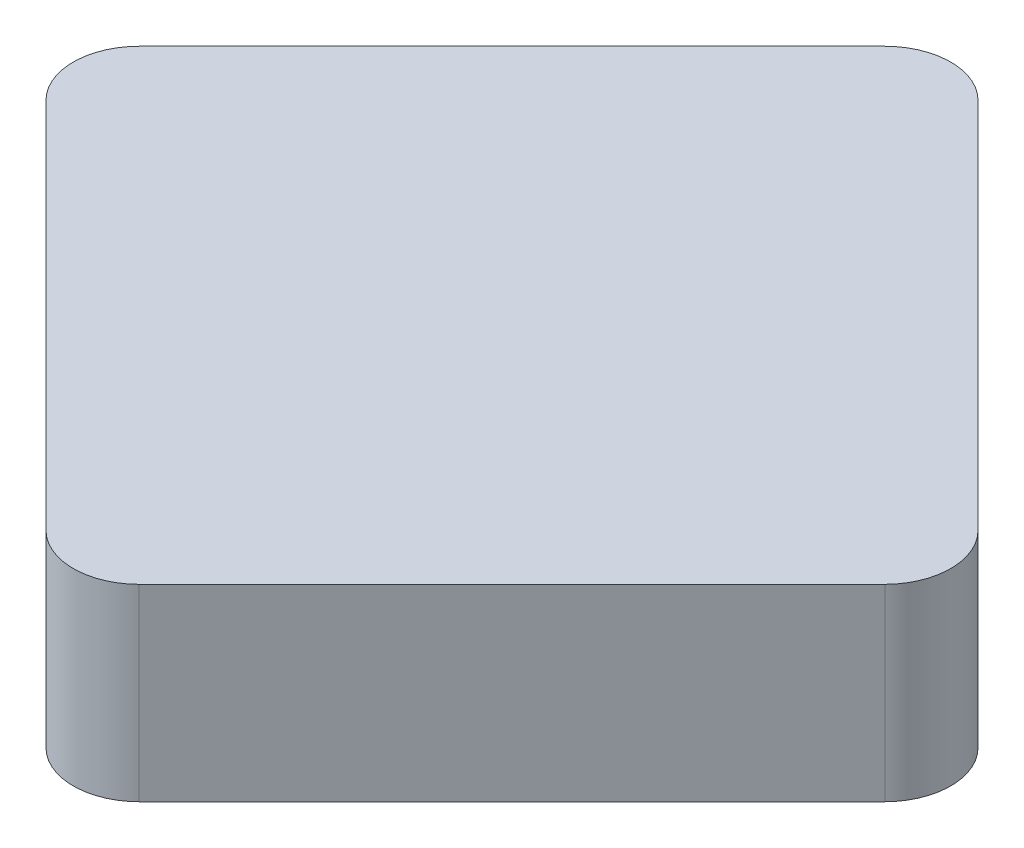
ISO-10303-21;
HEADER;
FILE_DESCRIPTION(('STEP AP214'),'2;1');
FILE_NAME('part.step','',(''),(''),'','','');
FILE_SCHEMA(('AUTOMOTIVE_DESIGN { 1 0 10303 214 1 1 1 1 }'));
ENDSEC;
DATA;
#1=APPLICATION_CONTEXT('core data for automotive mechanical design processes');
#2=APPLICATION_PROTOCOL_DEFINITION('international standard','automotive_design',2000,#1);
#3=PRODUCT_CONTEXT('',#1,'mechanical');
#4=PRODUCT('Part','Part','',(#3));
#5=PRODUCT_RELATED_PRODUCT_CATEGORY('part','',(#4));
#6=PRODUCT_DEFINITION_FORMATION('','',#4);
#7=PRODUCT_DEFINITION_CONTEXT('part definition',#1,'design');
#8=PRODUCT_DEFINITION('design','',#6,#7);
#9=PRODUCT_DEFINITION_SHAPE('','',#8);
#10=(LENGTH_UNIT() NAMED_UNIT(*) SI_UNIT(.MILLI.,.METRE.));
#11=(NAMED_UNIT(*) PLANE_ANGLE_UNIT() SI_UNIT($,.RADIAN.));
#12=(NAMED_UNIT(*) SI_UNIT($,.STERADIAN.) SOLID_ANGLE_UNIT());
#13=UNCERTAINTY_MEASURE_WITH_UNIT(LENGTH_MEASURE(1.E-05),#10,'distance_accuracy_value','');
#14=(GEOMETRIC_REPRESENTATION_CONTEXT(3) GLOBAL_UNCERTAINTY_ASSIGNED_CONTEXT((#13)) GLOBAL_UNIT_ASSIGNED_CONTEXT((#10,
#11,#12)) REPRESENTATION_CONTEXT('',''));
#15=CARTESIAN_POINT('',(0.,0.,0.));
#16=DIRECTION('',(0.,0.,1.));
#17=DIRECTION('',(1.,0.,0.));
#18=AXIS2_PLACEMENT_3D('',#15,#16,#17);
#19=CARTESIAN_POINT('',(0.,-0.0005,0.));
#20=DIRECTION('',(0.,1.,0.));
#21=DIRECTION('',(0.,0.,1.));
#22=AXIS2_PLACEMENT_3D('',#19,#20,#21);
#23=CYLINDRICAL_SURFACE('',#22,0.000500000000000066);
#24=CARTESIAN_POINT('',(0.,0.,0.));
#25=DIRECTION('',(0.,1.,0.));
#26=DIRECTION('',(0.,0.,1.));
#27=AXIS2_PLACEMENT_3D('',#24,#25,#26);
#28=CIRCLE('',#27,0.000500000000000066);
#29=CARTESIAN_POINT('',(0.,0.,0.000500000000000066));
#30=VERTEX_POINT('',#29);
#31=EDGE_CURVE('E11',#30,#30,#28,.F.);
#32=ORIENTED_EDGE('',*,*,#31,.F.);
#33=EDGE_LOOP('',(#32));
#34=FACE_BOUND('',#33,.T.);
#35=CARTESIAN_POINT('',(0.,0.0005,0.));
#36=DIRECTION('',(0.,1.,0.));
#37=DIRECTION('',(0.,0.,1.));
#38=AXIS2_PLACEMENT_3D('',#35,#36,#37);
#39=CIRCLE('',#38,0.000500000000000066);
#40=CARTESIAN_POINT('',(0.,0.0005,0.000500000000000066));
#41=VERTEX_POINT('',#40);
#42=EDGE_CURVE('E38',#41,#41,#39,.T.);
#43=ORIENTED_EDGE('',*,*,#42,.F.);
#44=EDGE_LOOP('',(#43));
#45=FACE_BOUND('',#44,.T.);
#46=ADVANCED_FACE('F30',(#34,#45),#23,.T.);
#47=CARTESIAN_POINT('',(0.,0.0005,0.));
#48=DIRECTION('',(0.,1.,0.));
#49=DIRECTION('',(0.,0.,1.));
#50=AXIS2_PLACEMENT_3D('',#47,#48,#49);
#51=PLANE('',#50);
#52=ORIENTED_EDGE('',*,*,#42,.T.);
#53=EDGE_LOOP('',(#52));
#54=FACE_BOUND('',#53,.T.);
#55=ADVANCED_FACE('F163',(#54),#51,.T.);
#56=CARTESIAN_POINT('',(0.,-3.42857142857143,0.));
#57=DIRECTION('',(0.,1.,0.));
#58=DIRECTION('',(0.,0.,1.));
#59=AXIS2_PLACEMENT_3D('',#56,#57,#58);
#60=CYLINDRICAL_SURFACE('',#59,1.2);
#61=CARTESIAN_POINT('',(0.,0.,0.));
#62=DIRECTION('',(0.,1.,0.));
#63=DIRECTION('',(0.,0.,1.));
#64=AXIS2_PLACEMENT_3D('',#61,#62,#63);
#65=CIRCLE('',#64,1.2);
#66=CARTESIAN_POINT('',(-0.848528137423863,0.,-0.84852813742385));
#67=VERTEX_POINT('',#66);
#68=CARTESIAN_POINT('',(-0.848528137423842,0.,0.848528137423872));
#69=VERTEX_POINT('',#68);
#70=EDGE_CURVE('E129',#67,#69,#65,.T.);
#71=ORIENTED_EDGE('',*,*,#70,.F.);
#72=DIRECTION('',(0.,1.,0.));
#73=VECTOR('',#72,1.);
#74=CARTESIAN_POINT('',(-0.848528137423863,-3.42857142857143,-0.84852813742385));
#75=LINE('',#74,#73);
#76=CARTESIAN_POINT('',(-0.848528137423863,-3.42857142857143,-0.84852813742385));
#77=VERTEX_POINT('',#76);
#78=EDGE_CURVE('E46',#77,#67,#75,.T.);
#79=ORIENTED_EDGE('',*,*,#78,.F.);
#80=CARTESIAN_POINT('',(0.,-3.42857142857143,0.));
#81=DIRECTION('',(0.,1.,0.));
#82=DIRECTION('',(0.,0.,1.));
#83=AXIS2_PLACEMENT_3D('',#80,#81,#82);
#84=CIRCLE('',#83,1.2);
#85=CARTESIAN_POINT('',(-0.848528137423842,-3.42857142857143,0.848528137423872));
#86=VERTEX_POINT('',#85);
#87=EDGE_CURVE('E150',#77,#86,#84,.T.);
#88=ORIENTED_EDGE('',*,*,#87,.T.);
#89=DIRECTION('',(0.,1.,0.));
#90=VECTOR('',#89,1.);
#91=CARTESIAN_POINT('',(-0.848528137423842,-3.42857142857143,0.848528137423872));
#92=LINE('',#91,#90);
#93=EDGE_CURVE('E87',#86,#69,#92,.T.);
#94=ORIENTED_EDGE('',*,*,#93,.T.);
#95=EDGE_LOOP('',(#71,#79,#88,#94));
#96=FACE_BOUND('',#95,.T.);
#97=ADVANCED_FACE('F170',(#96),#60,.T.);
#98=CARTESIAN_POINT('',(5.93969696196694,-3.42857142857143,-7.63675323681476));
#99=DIRECTION('',(-0.707106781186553,0.,-0.707106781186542));
#100=DIRECTION('',(-0.707106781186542,0.,0.707106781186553));
#101=AXIS2_PLACEMENT_3D('',#98,#99,#100);
#102=PLANE('',#101);
#103=DIRECTION('',(-0.707106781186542,0.,0.707106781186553));
#104=VECTOR('',#103,1.);
#105=CARTESIAN_POINT('',(5.93969696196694,0.,-7.63675323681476));
#106=LINE('',#105,#104);
#107=CARTESIAN_POINT('',(5.93969696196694,0.,-7.63675323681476));
#108=VERTEX_POINT('',#107);
#109=EDGE_CURVE('E147',#108,#67,#106,.T.);
#110=ORIENTED_EDGE('',*,*,#109,.F.);
#111=DIRECTION('',(0.,1.,0.));
#112=VECTOR('',#111,1.);
#113=CARTESIAN_POINT('',(5.93969696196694,-3.42857142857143,-7.63675323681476));
#114=LINE('',#113,#112);
#115=CARTESIAN_POINT('',(5.93969696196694,-3.42857142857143,-7.63675323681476));
#116=VERTEX_POINT('',#115);
#117=EDGE_CURVE('E75',#116,#108,#114,.T.);
#118=ORIENTED_EDGE('',*,*,#117,.F.);
#119=DIRECTION('',(-0.707106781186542,0.,0.707106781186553));
#120=VECTOR('',#119,1.);
#121=CARTESIAN_POINT('',(5.93969696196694,-3.42857142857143,-7.63675323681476));
#122=LINE('',#121,#120);
#123=EDGE_CURVE('E119',#116,#77,#122,.T.);
#124=ORIENTED_EDGE('',*,*,#123,.T.);
#125=ORIENTED_EDGE('',*,*,#78,.T.);
#126=EDGE_LOOP('',(#110,#118,#124,#125));
#127=FACE_BOUND('',#126,.T.);
#128=ADVANCED_FACE('F192',(#127),#102,.T.);
#129=CARTESIAN_POINT('',(6.7882250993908,-3.42857142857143,-6.78822509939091));
#130=DIRECTION('',(0.,1.,0.));
#131=DIRECTION('',(0.,0.,1.));
#132=AXIS2_PLACEMENT_3D('',#129,#130,#131);
#133=CYLINDRICAL_SURFACE('',#132,1.2);
#134=CARTESIAN_POINT('',(6.7882250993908,0.,-6.78822509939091));
#135=DIRECTION('',(0.,1.,0.));
#136=DIRECTION('',(0.,0.,1.));
#137=AXIS2_PLACEMENT_3D('',#134,#135,#136);
#138=CIRCLE('',#137,1.2);
#139=CARTESIAN_POINT('',(7.63675323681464,0.,-7.63675323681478));
#140=VERTEX_POINT('',#139);
#141=EDGE_CURVE('E106',#140,#108,#138,.T.);
#142=ORIENTED_EDGE('',*,*,#141,.F.);
#143=DIRECTION('',(0.,1.,0.));
#144=VECTOR('',#143,1.);
#145=CARTESIAN_POINT('',(7.63675323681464,-3.42857142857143,-7.63675323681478));
#146=LINE('',#145,#144);
#147=CARTESIAN_POINT('',(7.63675323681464,-3.42857142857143,-7.63675323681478));
#148=VERTEX_POINT('',#147);
#149=EDGE_CURVE('E101',#148,#140,#146,.T.);
#150=ORIENTED_EDGE('',*,*,#149,.F.);
#151=CARTESIAN_POINT('',(6.7882250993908,-3.42857142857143,-6.78822509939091));
#152=DIRECTION('',(0.,1.,0.));
#153=DIRECTION('',(0.,0.,1.));
#154=AXIS2_PLACEMENT_3D('',#151,#152,#153);
#155=CIRCLE('',#154,1.2);
#156=EDGE_CURVE('E104',#148,#116,#155,.T.);
#157=ORIENTED_EDGE('',*,*,#156,.T.);
#158=ORIENTED_EDGE('',*,*,#117,.T.);
#159=EDGE_LOOP('',(#142,#150,#157,#158));
#160=FACE_BOUND('',#159,.T.);
#161=ADVANCED_FACE('F103',(#160),#133,.T.);
#162=CARTESIAN_POINT('',(14.4249783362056,-3.42857142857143,-0.848528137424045));
#163=DIRECTION('',(0.707106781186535,0.,-0.70710678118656));
#164=DIRECTION('',(-0.70710678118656,0.,-0.707106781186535));
#165=AXIS2_PLACEMENT_3D('',#162,#163,#164);
#166=PLANE('',#165);
#167=DIRECTION('',(-0.70710678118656,0.,-0.707106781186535));
#168=VECTOR('',#167,1.);
#169=CARTESIAN_POINT('',(14.4249783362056,0.,-0.848528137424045));
#170=LINE('',#169,#168);
#171=CARTESIAN_POINT('',(14.4249783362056,0.,-0.848528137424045));
#172=VERTEX_POINT('',#171);
#173=EDGE_CURVE('E144',#172,#140,#170,.T.);
#174=ORIENTED_EDGE('',*,*,#173,.F.);
#175=DIRECTION('',(0.,1.,0.));
#176=VECTOR('',#175,1.);
#177=CARTESIAN_POINT('',(14.4249783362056,-3.42857142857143,-0.848528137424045));
#178=LINE('',#177,#176);
#179=CARTESIAN_POINT('',(14.4249783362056,-3.42857142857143,-0.848528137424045));
#180=VERTEX_POINT('',#179);
#181=EDGE_CURVE('E111',#180,#172,#178,.T.);
#182=ORIENTED_EDGE('',*,*,#181,.F.);
#183=DIRECTION('',(-0.70710678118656,0.,-0.707106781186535));
#184=VECTOR('',#183,1.);
#185=CARTESIAN_POINT('',(14.4249783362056,-3.42857142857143,-0.848528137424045));
#186=LINE('',#185,#184);
#187=EDGE_CURVE('E117',#180,#148,#186,.T.);
#188=ORIENTED_EDGE('',*,*,#187,.T.);
#189=ORIENTED_EDGE('',*,*,#149,.T.);
#190=EDGE_LOOP('',(#174,#182,#188,#189));
#191=FACE_BOUND('',#190,.T.);
#192=ADVANCED_FACE('F121',(#191),#166,.T.);
#193=CARTESIAN_POINT('',(13.5764501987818,-3.42857142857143,-1.74556549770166E-13));
#194=DIRECTION('',(0.,1.,0.));
#195=DIRECTION('',(0.,0.,1.));
#196=AXIS2_PLACEMENT_3D('',#193,#194,#195);
#197=CYLINDRICAL_SURFACE('',#196,1.2);
#198=CARTESIAN_POINT('',(13.5764501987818,0.,-1.74556549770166E-13));
#199=DIRECTION('',(0.,1.,0.));
#200=DIRECTION('',(0.,0.,1.));
#201=AXIS2_PLACEMENT_3D('',#198,#199,#200);
#202=CIRCLE('',#201,1.2);
#203=CARTESIAN_POINT('',(14.4249783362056,0.,0.848528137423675));
#204=VERTEX_POINT('',#203);
#205=EDGE_CURVE('E141',#204,#172,#202,.T.);
#206=ORIENTED_EDGE('',*,*,#205,.F.);
#207=DIRECTION('',(0.,1.,0.));
#208=VECTOR('',#207,1.);
#209=CARTESIAN_POINT('',(14.4249783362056,-3.42857142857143,0.848528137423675));
#210=LINE('',#209,#208);
#211=CARTESIAN_POINT('',(14.4249783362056,-3.42857142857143,0.848528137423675));
#212=VERTEX_POINT('',#211);
#213=EDGE_CURVE('E154',#212,#204,#210,.T.);
#214=ORIENTED_EDGE('',*,*,#213,.F.);
#215=CARTESIAN_POINT('',(13.5764501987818,-3.42857142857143,-1.74556549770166E-13));
#216=DIRECTION('',(0.,1.,0.));
#217=DIRECTION('',(0.,0.,1.));
#218=AXIS2_PLACEMENT_3D('',#215,#216,#217);
#219=CIRCLE('',#218,1.2);
#220=EDGE_CURVE('E122',#212,#180,#219,.T.);
#221=ORIENTED_EDGE('',*,*,#220,.T.);
#222=ORIENTED_EDGE('',*,*,#181,.T.);
#223=EDGE_LOOP('',(#206,#214,#221,#222));
#224=FACE_BOUND('',#223,.T.);
#225=ADVANCED_FACE('F191',(#224),#197,.T.);
#226=CARTESIAN_POINT('',(7.63675323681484,-3.42857142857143,7.63675323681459));
#227=DIRECTION('',(0.707106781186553,0.,0.707106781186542));
#228=DIRECTION('',(0.707106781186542,0.,-0.707106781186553));
#229=AXIS2_PLACEMENT_3D('',#226,#227,#228);
#230=PLANE('',#229);
#231=DIRECTION('',(0.707106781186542,0.,-0.707106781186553));
#232=VECTOR('',#231,1.);
#233=CARTESIAN_POINT('',(7.63675323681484,0.,7.63675323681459));
#234=LINE('',#233,#232);
#235=CARTESIAN_POINT('',(7.63675323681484,0.,7.63675323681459));
#236=VERTEX_POINT('',#235);
#237=EDGE_CURVE('E138',#236,#204,#234,.T.);
#238=ORIENTED_EDGE('',*,*,#237,.F.);
#239=DIRECTION('',(0.,1.,0.));
#240=VECTOR('',#239,1.);
#241=CARTESIAN_POINT('',(7.63675323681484,-3.42857142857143,7.63675323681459));
#242=LINE('',#241,#240);
#243=CARTESIAN_POINT('',(7.63675323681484,-3.42857142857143,7.63675323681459));
#244=VERTEX_POINT('',#243);
#245=EDGE_CURVE('E156',#244,#236,#242,.T.);
#246=ORIENTED_EDGE('',*,*,#245,.F.);
#247=DIRECTION('',(0.707106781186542,0.,-0.707106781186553));
#248=VECTOR('',#247,1.);
#249=CARTESIAN_POINT('',(7.63675323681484,-3.42857142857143,7.63675323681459));
#250=LINE('',#249,#248);
#251=EDGE_CURVE('E124',#244,#212,#250,.T.);
#252=ORIENTED_EDGE('',*,*,#251,.T.);
#253=ORIENTED_EDGE('',*,*,#213,.T.);
#254=EDGE_LOOP('',(#238,#246,#252,#253));
#255=FACE_BOUND('',#254,.T.);
#256=ADVANCED_FACE('F187',(#255),#230,.T.);
#257=CARTESIAN_POINT('',(6.78822509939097,-3.42857142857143,6.78822509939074));
#258=DIRECTION('',(0.,1.,0.));
#259=DIRECTION('',(0.,0.,1.));
#260=AXIS2_PLACEMENT_3D('',#257,#258,#259);
#261=CYLINDRICAL_SURFACE('',#260,1.2);
#262=CARTESIAN_POINT('',(6.78822509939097,0.,6.78822509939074));
#263=DIRECTION('',(0.,1.,0.));
#264=DIRECTION('',(0.,0.,1.));
#265=AXIS2_PLACEMENT_3D('',#262,#263,#264);
#266=CIRCLE('',#265,1.2);
#267=CARTESIAN_POINT('',(5.93969696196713,0.,7.63675323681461));
#268=VERTEX_POINT('',#267);
#269=EDGE_CURVE('E135',#268,#236,#266,.T.);
#270=ORIENTED_EDGE('',*,*,#269,.F.);
#271=DIRECTION('',(0.,1.,0.));
#272=VECTOR('',#271,1.);
#273=CARTESIAN_POINT('',(5.93969696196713,-3.42857142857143,7.63675323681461));
#274=LINE('',#273,#272);
#275=CARTESIAN_POINT('',(5.93969696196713,-3.42857142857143,7.63675323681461));
#276=VERTEX_POINT('',#275);
#277=EDGE_CURVE('E158',#276,#268,#274,.T.);
#278=ORIENTED_EDGE('',*,*,#277,.F.);
#279=CARTESIAN_POINT('',(6.78822509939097,-3.42857142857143,6.78822509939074));
#280=DIRECTION('',(0.,1.,0.));
#281=DIRECTION('',(0.,0.,1.));
#282=AXIS2_PLACEMENT_3D('',#279,#280,#281);
#283=CIRCLE('',#282,1.2);
#284=EDGE_CURVE('E281',#276,#244,#283,.T.);
#285=ORIENTED_EDGE('',*,*,#284,.T.);
#286=ORIENTED_EDGE('',*,*,#245,.T.);
#287=EDGE_LOOP('',(#270,#278,#285,#286));
#288=FACE_BOUND('',#287,.T.);
#289=ADVANCED_FACE('F183',(#288),#261,.T.);
#290=CARTESIAN_POINT('',(-0.848528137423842,-3.42857142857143,0.848528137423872));
#291=DIRECTION('',(-0.707106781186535,0.,0.70710678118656));
#292=DIRECTION('',(0.70710678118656,0.,0.707106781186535));
#293=AXIS2_PLACEMENT_3D('',#290,#291,#292);
#294=PLANE('',#293);
#295=DIRECTION('',(0.70710678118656,0.,0.707106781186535));
#296=VECTOR('',#295,1.);
#297=CARTESIAN_POINT('',(-0.848528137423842,0.,0.848528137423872));
#298=LINE('',#297,#296);
#299=EDGE_CURVE('E132',#69,#268,#298,.T.);
#300=ORIENTED_EDGE('',*,*,#299,.F.);
#301=ORIENTED_EDGE('',*,*,#93,.F.);
#302=DIRECTION('',(0.70710678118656,0.,0.707106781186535));
#303=VECTOR('',#302,1.);
#304=CARTESIAN_POINT('',(-0.848528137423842,-3.42857142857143,0.848528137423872));
#305=LINE('',#304,#303);
#306=EDGE_CURVE('E179',#86,#276,#305,.T.);
#307=ORIENTED_EDGE('',*,*,#306,.T.);
#308=ORIENTED_EDGE('',*,*,#277,.T.);
#309=EDGE_LOOP('',(#300,#301,#307,#308));
#310=FACE_BOUND('',#309,.T.);
#311=ADVANCED_FACE('F177',(#310),#294,.T.);
#312=CARTESIAN_POINT('',(0.,-3.42857142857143,0.));
#313=DIRECTION('',(0.,1.,0.));
#314=DIRECTION('',(0.,0.,1.));
#315=AXIS2_PLACEMENT_3D('',#312,#313,#314);
#316=PLANE('',#315);
#317=ORIENTED_EDGE('',*,*,#87,.F.);
#318=ORIENTED_EDGE('',*,*,#123,.F.);
#319=ORIENTED_EDGE('',*,*,#156,.F.);
#320=ORIENTED_EDGE('',*,*,#187,.F.);
#321=ORIENTED_EDGE('',*,*,#220,.F.);
#322=ORIENTED_EDGE('',*,*,#251,.F.);
#323=ORIENTED_EDGE('',*,*,#284,.F.);
#324=ORIENTED_EDGE('',*,*,#306,.F.);
#325=EDGE_LOOP('',(#317,#318,#319,#320,#321,#322,#323,#324));
#326=FACE_BOUND('',#325,.T.);
#327=ADVANCED_FACE('F115',(#326),#316,.F.);
#328=CARTESIAN_POINT('',(0.,0.,0.));
#329=DIRECTION('',(0.,1.,0.));
#330=DIRECTION('',(0.,0.,1.));
#331=AXIS2_PLACEMENT_3D('',#328,#329,#330);
#332=PLANE('',#331);
#333=ORIENTED_EDGE('',*,*,#31,.T.);
#334=EDGE_LOOP('',(#333));
#335=FACE_BOUND('',#334,.T.);
#336=ORIENTED_EDGE('',*,*,#70,.T.);
#337=ORIENTED_EDGE('',*,*,#299,.T.);
#338=ORIENTED_EDGE('',*,*,#269,.T.);
#339=ORIENTED_EDGE('',*,*,#237,.T.);
#340=ORIENTED_EDGE('',*,*,#205,.T.);
#341=ORIENTED_EDGE('',*,*,#173,.T.);
#342=ORIENTED_EDGE('',*,*,#141,.T.);
#343=ORIENTED_EDGE('',*,*,#109,.T.);
#344=EDGE_LOOP('',(#336,#337,#338,#339,#340,#341,#342,#343));
#345=FACE_BOUND('',#344,.T.);
#346=ADVANCED_FACE('F173',(#335,#345),#332,.T.);
#347=CLOSED_SHELL('',(#46,#55,#97,#128,#161,#192,#225,#256,#289,#311,#327,#346));
#348=MANIFOLD_SOLID_BREP('B2',#347);
#349=ADVANCED_BREP_SHAPE_REPRESENTATION('',(#18,#348),#14);
#350=SHAPE_DEFINITION_REPRESENTATION(#9,#349);
ENDSEC;
END-ISO-10303-21;
